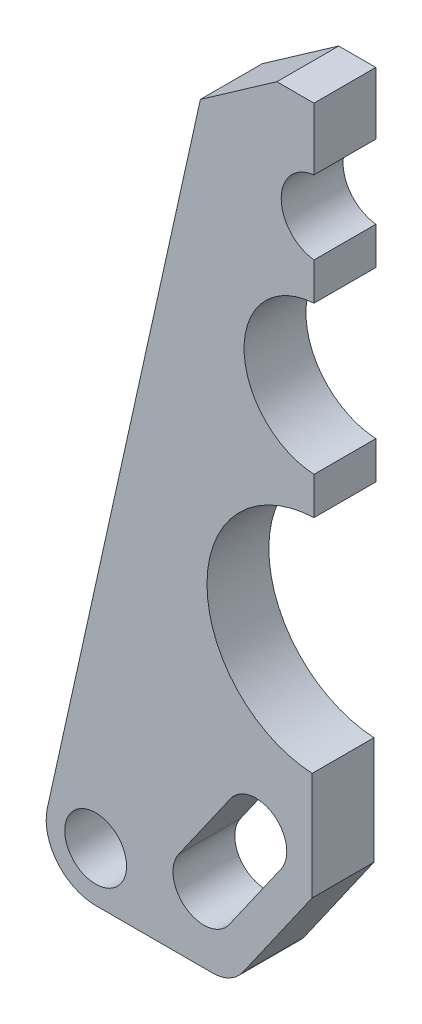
ISO-10303-21;
HEADER;
FILE_DESCRIPTION(('STEP AP214'),'2;1');
FILE_NAME('part.step','',(''),(''),'','','');
FILE_SCHEMA(('AUTOMOTIVE_DESIGN { 1 0 10303 214 1 1 1 1 }'));
ENDSEC;
DATA;
#1=APPLICATION_CONTEXT('core data for automotive mechanical design processes');
#2=APPLICATION_PROTOCOL_DEFINITION('international standard','automotive_design',2000,#1);
#3=PRODUCT_CONTEXT('',#1,'mechanical');
#4=PRODUCT('Part','Part','',(#3));
#5=PRODUCT_RELATED_PRODUCT_CATEGORY('part','',(#4));
#6=PRODUCT_DEFINITION_FORMATION('','',#4);
#7=PRODUCT_DEFINITION_CONTEXT('part definition',#1,'design');
#8=PRODUCT_DEFINITION('design','',#6,#7);
#9=PRODUCT_DEFINITION_SHAPE('','',#8);
#10=(LENGTH_UNIT() NAMED_UNIT(*) SI_UNIT(.MILLI.,.METRE.));
#11=(NAMED_UNIT(*) PLANE_ANGLE_UNIT() SI_UNIT($,.RADIAN.));
#12=(NAMED_UNIT(*) SI_UNIT($,.STERADIAN.) SOLID_ANGLE_UNIT());
#13=UNCERTAINTY_MEASURE_WITH_UNIT(LENGTH_MEASURE(1.E-05),#10,'distance_accuracy_value','');
#14=(GEOMETRIC_REPRESENTATION_CONTEXT(3) GLOBAL_UNCERTAINTY_ASSIGNED_CONTEXT((#13)) GLOBAL_UNIT_ASSIGNED_CONTEXT((#10,
#11,#12)) REPRESENTATION_CONTEXT('',''));
#15=CARTESIAN_POINT('',(0.,0.,0.));
#16=DIRECTION('',(0.,0.,1.));
#17=DIRECTION('',(1.,0.,0.));
#18=AXIS2_PLACEMENT_3D('',#15,#16,#17);
#19=CARTESIAN_POINT('',(-18.,-4.,5.));
#20=DIRECTION('',(0.,0.,1.));
#21=DIRECTION('',(1.,0.,0.));
#22=AXIS2_PLACEMENT_3D('',#19,#20,#21);
#23=PLANE('',#22);
#24=CARTESIAN_POINT('',(-18.,-4.,5.));
#25=DIRECTION('',(0.,0.,1.));
#26=DIRECTION('',(1.,0.,0.));
#27=AXIS2_PLACEMENT_3D('',#24,#25,#26);
#28=CIRCLE('',#27,2.5);
#29=CARTESIAN_POINT('',(-15.5,-4.,5.));
#30=VERTEX_POINT('',#29);
#31=EDGE_CURVE('E206',#30,#30,#28,.T.);
#32=ORIENTED_EDGE('',*,*,#31,.F.);
#33=EDGE_LOOP('',(#32));
#34=FACE_BOUND('',#33,.T.);
#35=DIRECTION('',(1.,0.,0.));
#36=VECTOR('',#35,1.);
#37=CARTESIAN_POINT('',(-6.9972685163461,-8.,5.));
#38=LINE('',#37,#36);
#39=CARTESIAN_POINT('',(-18.,-8.,5.));
#40=VERTEX_POINT('',#39);
#41=CARTESIAN_POINT('',(-8.55896966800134,-8.,5.));
#42=VERTEX_POINT('',#41);
#43=EDGE_CURVE('E235',#40,#42,#38,.T.);
#44=ORIENTED_EDGE('',*,*,#43,.T.);
#45=CARTESIAN_POINT('',(-8.55896966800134,-5.,5.));
#46=DIRECTION('',(0.,0.,1.));
#47=DIRECTION('',(1.,0.,0.));
#48=AXIS2_PLACEMENT_3D('',#45,#46,#47);
#49=CIRCLE('',#48,3.);
#50=CARTESIAN_POINT('',(-6.10151353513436,-6.72072930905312,5.));
#51=VERTEX_POINT('',#50);
#52=EDGE_CURVE('E11',#42,#51,#49,.T.);
#53=ORIENTED_EDGE('',*,*,#52,.T.);
#54=DIRECTION('',(0.573576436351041,0.819152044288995,0.));
#55=VECTOR('',#54,1.);
#56=CARTESIAN_POINT('',(-6.9972685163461,-8.,5.));
#57=LINE('',#56,#55);
#58=CARTESIAN_POINT('',(-0.499999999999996,1.27906108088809,5.));
#59=VERTEX_POINT('',#58);
#60=EDGE_CURVE('E237',#51,#59,#57,.T.);
#61=ORIENTED_EDGE('',*,*,#60,.T.);
#62=DIRECTION('',(0.,1.,0.));
#63=VECTOR('',#62,1.);
#64=CARTESIAN_POINT('',(-0.499999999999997,10.0002211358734,5.));
#65=LINE('',#64,#63);
#66=CARTESIAN_POINT('',(-0.499999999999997,10.0002211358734,5.));
#67=VERTEX_POINT('',#66);
#68=EDGE_CURVE('E239',#59,#67,#65,.T.);
#69=ORIENTED_EDGE('',*,*,#68,.T.);
#70=CARTESIAN_POINT('',(0.,18.9863215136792,5.));
#71=DIRECTION('',(0.,0.,-1.));
#72=DIRECTION('',(1.,0.,0.));
#73=AXIS2_PLACEMENT_3D('',#70,#71,#72);
#74=CIRCLE('',#73,9.);
#75=CARTESIAN_POINT('',(-0.349999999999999,27.9795133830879,5.));
#76=VERTEX_POINT('',#75);
#77=EDGE_CURVE('E241',#67,#76,#74,.T.);
#78=ORIENTED_EDGE('',*,*,#77,.T.);
#79=DIRECTION('',(0.,1.,0.));
#80=VECTOR('',#79,1.);
#81=CARTESIAN_POINT('',(-0.349999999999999,31.0102170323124,5.));
#82=LINE('',#81,#80);
#83=CARTESIAN_POINT('',(-0.349999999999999,31.0102170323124,5.));
#84=VERTEX_POINT('',#83);
#85=EDGE_CURVE('E243',#76,#84,#82,.T.);
#86=ORIENTED_EDGE('',*,*,#85,.T.);
#87=CARTESIAN_POINT('',(0.,37.,5.));
#88=DIRECTION('',(0.,0.,-1.));
#89=DIRECTION('',(1.,0.,0.));
#90=AXIS2_PLACEMENT_3D('',#87,#88,#89);
#91=CIRCLE('',#90,6.);
#92=CARTESIAN_POINT('',(-0.350000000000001,42.9897829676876,5.));
#93=VERTEX_POINT('',#92);
#94=EDGE_CURVE('E245',#84,#93,#91,.T.);
#95=ORIENTED_EDGE('',*,*,#94,.T.);
#96=DIRECTION('',(0.,1.,0.));
#97=VECTOR('',#96,1.);
#98=CARTESIAN_POINT('',(-0.350000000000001,46.0204866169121,5.));
#99=LINE('',#98,#97);
#100=CARTESIAN_POINT('',(-0.350000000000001,46.0204866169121,5.));
#101=VERTEX_POINT('',#100);
#102=EDGE_CURVE('E247',#93,#101,#99,.T.);
#103=ORIENTED_EDGE('',*,*,#102,.T.);
#104=CARTESIAN_POINT('',(0.,49.,5.));
#105=DIRECTION('',(0.,0.,-1.));
#106=DIRECTION('',(1.,0.,0.));
#107=AXIS2_PLACEMENT_3D('',#104,#105,#106);
#108=CIRCLE('',#107,3.);
#109=CARTESIAN_POINT('',(-0.350000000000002,51.9795133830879,5.));
#110=VERTEX_POINT('',#109);
#111=EDGE_CURVE('E249',#101,#110,#108,.T.);
#112=ORIENTED_EDGE('',*,*,#111,.T.);
#113=DIRECTION('',(0.,1.,0.));
#114=VECTOR('',#113,1.);
#115=CARTESIAN_POINT('',(-0.350000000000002,51.9795133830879,5.));
#116=LINE('',#115,#114);
#117=CARTESIAN_POINT('',(-0.350000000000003,57.,5.));
#118=VERTEX_POINT('',#117);
#119=EDGE_CURVE('E251',#110,#118,#116,.T.);
#120=ORIENTED_EDGE('',*,*,#119,.T.);
#121=DIRECTION('',(-1.,0.,0.));
#122=VECTOR('',#121,1.);
#123=CARTESIAN_POINT('',(-3.35,57.,5.));
#124=LINE('',#123,#122);
#125=CARTESIAN_POINT('',(-3.35,57.,5.));
#126=VERTEX_POINT('',#125);
#127=EDGE_CURVE('E253',#118,#126,#124,.T.);
#128=ORIENTED_EDGE('',*,*,#127,.T.);
#129=DIRECTION('',(-0.819152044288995,-0.573576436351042,0.));
#130=VECTOR('',#129,1.);
#131=CARTESIAN_POINT('',(-3.35,57.,5.));
#132=LINE('',#131,#130);
#133=CARTESIAN_POINT('',(-9.53364489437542,52.6701652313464,5.));
#134=VERTEX_POINT('',#133);
#135=EDGE_CURVE('E255',#126,#134,#132,.T.);
#136=ORIENTED_EDGE('',*,*,#135,.T.);
#137=DIRECTION('',(-0.216439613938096,-0.976296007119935,0.));
#138=VECTOR('',#137,1.);
#139=CARTESIAN_POINT('',(-21.9051840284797,-3.13424154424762,5.));
#140=LINE('',#139,#138);
#141=CARTESIAN_POINT('',(-21.9051840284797,-3.13424154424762,5.));
#142=VERTEX_POINT('',#141);
#143=EDGE_CURVE('E257',#134,#142,#140,.T.);
#144=ORIENTED_EDGE('',*,*,#143,.T.);
#145=CARTESIAN_POINT('',(-18.,-4.,5.));
#146=DIRECTION('',(0.,0.,1.));
#147=DIRECTION('',(1.,0.,0.));
#148=AXIS2_PLACEMENT_3D('',#145,#146,#147);
#149=CIRCLE('',#148,4.);
#150=EDGE_CURVE('E259',#142,#40,#149,.T.);
#151=ORIENTED_EDGE('',*,*,#150,.T.);
#152=EDGE_LOOP('',(#44,#53,#61,#69,#78,#86,#95,#103,#112,#120,#128,#136,#144,#151));
#153=FACE_BOUND('',#152,.T.);
#154=DIRECTION('',(0.573576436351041,0.819152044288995,0.));
#155=VECTOR('',#154,1.);
#156=CARTESIAN_POINT('',(-7.20211988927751,-3.9339410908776,5.));
#157=LINE('',#156,#155);
#158=CARTESIAN_POINT('',(-7.20211988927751,-3.9339410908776,5.));
#159=VERTEX_POINT('',#158);
#160=CARTESIAN_POINT('',(-3.0008746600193,2.0660589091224,5.));
#161=VERTEX_POINT('',#160);
#162=EDGE_CURVE('E192',#159,#161,#157,.T.);
#163=ORIENTED_EDGE('',*,*,#162,.F.);
#164=CARTESIAN_POINT('',(-9.24999999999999,-2.5,5.));
#165=DIRECTION('',(0.,0.,1.));
#166=DIRECTION('',(1.,0.,0.));
#167=AXIS2_PLACEMENT_3D('',#164,#165,#166);
#168=CIRCLE('',#167,2.5);
#169=CARTESIAN_POINT('',(-11.2978801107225,-1.0660589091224,5.));
#170=VERTEX_POINT('',#169);
#171=EDGE_CURVE('E180',#170,#159,#168,.T.);
#172=ORIENTED_EDGE('',*,*,#171,.F.);
#173=DIRECTION('',(-0.573576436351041,-0.819152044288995,0.));
#174=VECTOR('',#173,1.);
#175=CARTESIAN_POINT('',(-11.2978801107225,-1.0660589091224,5.));
#176=LINE('',#175,#174);
#177=CARTESIAN_POINT('',(-7.09663488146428,4.9339410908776,5.));
#178=VERTEX_POINT('',#177);
#179=EDGE_CURVE('E197',#178,#170,#176,.T.);
#180=ORIENTED_EDGE('',*,*,#179,.F.);
#181=CARTESIAN_POINT('',(-5.04875477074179,3.5,5.));
#182=DIRECTION('',(0.,0.,1.));
#183=DIRECTION('',(1.,0.,0.));
#184=AXIS2_PLACEMENT_3D('',#181,#182,#183);
#185=CIRCLE('',#184,2.5);
#186=EDGE_CURVE('E194',#161,#178,#185,.T.);
#187=ORIENTED_EDGE('',*,*,#186,.F.);
#188=EDGE_LOOP('',(#163,#172,#180,#187));
#189=FACE_BOUND('',#188,.T.);
#190=ADVANCED_FACE('F36',(#34,#153,#189),#23,.T.);
#191=CARTESIAN_POINT('',(-18.,-4.,0.));
#192=DIRECTION('',(0.,0.,1.));
#193=DIRECTION('',(1.,0.,0.));
#194=AXIS2_PLACEMENT_3D('',#191,#192,#193);
#195=PLANE('',#194);
#196=CARTESIAN_POINT('',(-18.,-4.,0.));
#197=DIRECTION('',(0.,0.,1.));
#198=DIRECTION('',(1.,0.,0.));
#199=AXIS2_PLACEMENT_3D('',#196,#197,#198);
#200=CIRCLE('',#199,2.5);
#201=CARTESIAN_POINT('',(-15.5,-4.,0.));
#202=VERTEX_POINT('',#201);
#203=EDGE_CURVE('E181',#202,#202,#200,.T.);
#204=ORIENTED_EDGE('',*,*,#203,.T.);
#205=EDGE_LOOP('',(#204));
#206=FACE_BOUND('',#205,.T.);
#207=DIRECTION('',(0.573576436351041,0.819152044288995,0.));
#208=VECTOR('',#207,1.);
#209=CARTESIAN_POINT('',(-6.9972685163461,-8.,0.));
#210=LINE('',#209,#208);
#211=CARTESIAN_POINT('',(-6.10151353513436,-6.72072930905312,0.));
#212=VERTEX_POINT('',#211);
#213=CARTESIAN_POINT('',(-0.499999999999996,1.27906108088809,0.));
#214=VERTEX_POINT('',#213);
#215=EDGE_CURVE('E211',#212,#214,#210,.T.);
#216=ORIENTED_EDGE('',*,*,#215,.F.);
#217=CARTESIAN_POINT('',(-8.55896966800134,-5.,0.));
#218=DIRECTION('',(0.,0.,1.));
#219=DIRECTION('',(1.,0.,0.));
#220=AXIS2_PLACEMENT_3D('',#217,#218,#219);
#221=CIRCLE('',#220,3.);
#222=CARTESIAN_POINT('',(-8.55896966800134,-8.,0.));
#223=VERTEX_POINT('',#222);
#224=EDGE_CURVE('E58',#212,#223,#221,.F.);
#225=ORIENTED_EDGE('',*,*,#224,.T.);
#226=DIRECTION('',(1.,0.,0.));
#227=VECTOR('',#226,1.);
#228=CARTESIAN_POINT('',(-6.9972685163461,-8.,0.));
#229=LINE('',#228,#227);
#230=CARTESIAN_POINT('',(-18.,-8.,0.));
#231=VERTEX_POINT('',#230);
#232=EDGE_CURVE('E209',#231,#223,#229,.T.);
#233=ORIENTED_EDGE('',*,*,#232,.F.);
#234=CARTESIAN_POINT('',(-18.,-4.,0.));
#235=DIRECTION('',(0.,0.,1.));
#236=DIRECTION('',(1.,0.,0.));
#237=AXIS2_PLACEMENT_3D('',#234,#235,#236);
#238=CIRCLE('',#237,4.);
#239=CARTESIAN_POINT('',(-21.9051840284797,-3.13424154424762,0.));
#240=VERTEX_POINT('',#239);
#241=EDGE_CURVE('E233',#240,#231,#238,.T.);
#242=ORIENTED_EDGE('',*,*,#241,.F.);
#243=DIRECTION('',(-0.216439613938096,-0.976296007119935,0.));
#244=VECTOR('',#243,1.);
#245=CARTESIAN_POINT('',(-21.9051840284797,-3.13424154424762,0.));
#246=LINE('',#245,#244);
#247=CARTESIAN_POINT('',(-9.53364489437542,52.6701652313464,0.));
#248=VERTEX_POINT('',#247);
#249=EDGE_CURVE('E231',#248,#240,#246,.T.);
#250=ORIENTED_EDGE('',*,*,#249,.F.);
#251=DIRECTION('',(-0.819152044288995,-0.573576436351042,0.));
#252=VECTOR('',#251,1.);
#253=CARTESIAN_POINT('',(-3.35,57.,0.));
#254=LINE('',#253,#252);
#255=CARTESIAN_POINT('',(-3.35,57.,0.));
#256=VERTEX_POINT('',#255);
#257=EDGE_CURVE('E229',#256,#248,#254,.T.);
#258=ORIENTED_EDGE('',*,*,#257,.F.);
#259=DIRECTION('',(-1.,0.,0.));
#260=VECTOR('',#259,1.);
#261=CARTESIAN_POINT('',(-3.35,57.,0.));
#262=LINE('',#261,#260);
#263=CARTESIAN_POINT('',(-0.350000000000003,57.,0.));
#264=VERTEX_POINT('',#263);
#265=EDGE_CURVE('E227',#264,#256,#262,.T.);
#266=ORIENTED_EDGE('',*,*,#265,.F.);
#267=DIRECTION('',(0.,1.,0.));
#268=VECTOR('',#267,1.);
#269=CARTESIAN_POINT('',(-0.350000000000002,51.9795133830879,0.));
#270=LINE('',#269,#268);
#271=CARTESIAN_POINT('',(-0.350000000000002,51.9795133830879,0.));
#272=VERTEX_POINT('',#271);
#273=EDGE_CURVE('E225',#272,#264,#270,.T.);
#274=ORIENTED_EDGE('',*,*,#273,.F.);
#275=CARTESIAN_POINT('',(0.,49.,0.));
#276=DIRECTION('',(0.,0.,-1.));
#277=DIRECTION('',(1.,0.,0.));
#278=AXIS2_PLACEMENT_3D('',#275,#276,#277);
#279=CIRCLE('',#278,3.);
#280=CARTESIAN_POINT('',(-0.350000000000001,46.0204866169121,0.));
#281=VERTEX_POINT('',#280);
#282=EDGE_CURVE('E223',#281,#272,#279,.T.);
#283=ORIENTED_EDGE('',*,*,#282,.F.);
#284=DIRECTION('',(0.,1.,0.));
#285=VECTOR('',#284,1.);
#286=CARTESIAN_POINT('',(-0.350000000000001,46.0204866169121,0.));
#287=LINE('',#286,#285);
#288=CARTESIAN_POINT('',(-0.350000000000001,42.9897829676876,0.));
#289=VERTEX_POINT('',#288);
#290=EDGE_CURVE('E221',#289,#281,#287,.T.);
#291=ORIENTED_EDGE('',*,*,#290,.F.);
#292=CARTESIAN_POINT('',(0.,37.,0.));
#293=DIRECTION('',(0.,0.,-1.));
#294=DIRECTION('',(1.,0.,0.));
#295=AXIS2_PLACEMENT_3D('',#292,#293,#294);
#296=CIRCLE('',#295,6.);
#297=CARTESIAN_POINT('',(-0.349999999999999,31.0102170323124,0.));
#298=VERTEX_POINT('',#297);
#299=EDGE_CURVE('E219',#298,#289,#296,.T.);
#300=ORIENTED_EDGE('',*,*,#299,.F.);
#301=DIRECTION('',(0.,1.,0.));
#302=VECTOR('',#301,1.);
#303=CARTESIAN_POINT('',(-0.349999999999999,31.0102170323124,0.));
#304=LINE('',#303,#302);
#305=CARTESIAN_POINT('',(-0.349999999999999,27.9795133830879,0.));
#306=VERTEX_POINT('',#305);
#307=EDGE_CURVE('E217',#306,#298,#304,.T.);
#308=ORIENTED_EDGE('',*,*,#307,.F.);
#309=CARTESIAN_POINT('',(0.,18.9863215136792,0.));
#310=DIRECTION('',(0.,0.,-1.));
#311=DIRECTION('',(1.,0.,0.));
#312=AXIS2_PLACEMENT_3D('',#309,#310,#311);
#313=CIRCLE('',#312,9.);
#314=CARTESIAN_POINT('',(-0.499999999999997,10.0002211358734,0.));
#315=VERTEX_POINT('',#314);
#316=EDGE_CURVE('E215',#315,#306,#313,.T.);
#317=ORIENTED_EDGE('',*,*,#316,.F.);
#318=DIRECTION('',(0.,1.,0.));
#319=VECTOR('',#318,1.);
#320=CARTESIAN_POINT('',(-0.499999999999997,10.0002211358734,0.));
#321=LINE('',#320,#319);
#322=EDGE_CURVE('E213',#214,#315,#321,.T.);
#323=ORIENTED_EDGE('',*,*,#322,.F.);
#324=EDGE_LOOP('',(#216,#225,#233,#242,#250,#258,#266,#274,#283,#291,#300,#308,#317,#323));
#325=FACE_BOUND('',#324,.T.);
#326=CARTESIAN_POINT('',(-9.24999999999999,-2.5,0.));
#327=DIRECTION('',(0.,0.,1.));
#328=DIRECTION('',(1.,0.,0.));
#329=AXIS2_PLACEMENT_3D('',#326,#327,#328);
#330=CIRCLE('',#329,2.5);
#331=CARTESIAN_POINT('',(-11.2978801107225,-1.0660589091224,0.));
#332=VERTEX_POINT('',#331);
#333=CARTESIAN_POINT('',(-7.20211988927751,-3.9339410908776,0.));
#334=VERTEX_POINT('',#333);
#335=EDGE_CURVE('E173',#332,#334,#330,.T.);
#336=ORIENTED_EDGE('',*,*,#335,.T.);
#337=DIRECTION('',(0.573576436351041,0.819152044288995,0.));
#338=VECTOR('',#337,1.);
#339=CARTESIAN_POINT('',(-7.20211988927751,-3.9339410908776,0.));
#340=LINE('',#339,#338);
#341=CARTESIAN_POINT('',(-3.0008746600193,2.0660589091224,0.));
#342=VERTEX_POINT('',#341);
#343=EDGE_CURVE('E161',#334,#342,#340,.T.);
#344=ORIENTED_EDGE('',*,*,#343,.T.);
#345=CARTESIAN_POINT('',(-5.04875477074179,3.5,0.));
#346=DIRECTION('',(0.,0.,1.));
#347=DIRECTION('',(1.,0.,0.));
#348=AXIS2_PLACEMENT_3D('',#345,#346,#347);
#349=CIRCLE('',#348,2.5);
#350=CARTESIAN_POINT('',(-7.09663488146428,4.9339410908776,0.));
#351=VERTEX_POINT('',#350);
#352=EDGE_CURVE('E172',#342,#351,#349,.T.);
#353=ORIENTED_EDGE('',*,*,#352,.T.);
#354=DIRECTION('',(-0.573576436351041,-0.819152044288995,0.));
#355=VECTOR('',#354,1.);
#356=CARTESIAN_POINT('',(-11.2978801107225,-1.0660589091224,0.));
#357=LINE('',#356,#355);
#358=EDGE_CURVE('E186',#351,#332,#357,.T.);
#359=ORIENTED_EDGE('',*,*,#358,.T.);
#360=EDGE_LOOP('',(#336,#344,#353,#359));
#361=FACE_BOUND('',#360,.T.);
#362=ADVANCED_FACE('F184',(#206,#325,#361),#195,.F.);
#363=CARTESIAN_POINT('',(-6.9972685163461,-8.,5.));
#364=DIRECTION('',(0.,1.,0.));
#365=DIRECTION('',(-1.,0.,0.));
#366=AXIS2_PLACEMENT_3D('',#363,#364,#365);
#367=PLANE('',#366);
#368=ORIENTED_EDGE('',*,*,#232,.T.);
#369=DIRECTION('',(0.,0.,-1.));
#370=VECTOR('',#369,1.);
#371=CARTESIAN_POINT('',(-8.55896966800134,-8.,5.));
#372=LINE('',#371,#370);
#373=EDGE_CURVE('E44',#223,#42,#372,.F.);
#374=ORIENTED_EDGE('',*,*,#373,.T.);
#375=ORIENTED_EDGE('',*,*,#43,.F.);
#376=DIRECTION('',(0.,0.,-1.));
#377=VECTOR('',#376,1.);
#378=CARTESIAN_POINT('',(-18.,-8.,5.));
#379=LINE('',#378,#377);
#380=EDGE_CURVE('E261',#40,#231,#379,.T.);
#381=ORIENTED_EDGE('',*,*,#380,.T.);
#382=EDGE_LOOP('',(#368,#374,#375,#381));
#383=FACE_BOUND('',#382,.T.);
#384=ADVANCED_FACE('F38',(#383),#367,.F.);
#385=CARTESIAN_POINT('',(-6.9972685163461,-8.,5.));
#386=DIRECTION('',(-0.819152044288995,0.573576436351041,0.));
#387=DIRECTION('',(-0.573576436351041,-0.819152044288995,0.));
#388=AXIS2_PLACEMENT_3D('',#385,#386,#387);
#389=PLANE('',#388);
#390=ORIENTED_EDGE('',*,*,#60,.F.);
#391=DIRECTION('',(0.,0.,-1.));
#392=VECTOR('',#391,1.);
#393=CARTESIAN_POINT('',(-6.10151353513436,-6.72072930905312,5.));
#394=LINE('',#393,#392);
#395=EDGE_CURVE('E297',#51,#212,#394,.T.);
#396=ORIENTED_EDGE('',*,*,#395,.T.);
#397=ORIENTED_EDGE('',*,*,#215,.T.);
#398=DIRECTION('',(0.,0.,-1.));
#399=VECTOR('',#398,1.);
#400=CARTESIAN_POINT('',(-0.499999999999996,1.27906108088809,5.));
#401=LINE('',#400,#399);
#402=EDGE_CURVE('E294',#59,#214,#401,.T.);
#403=ORIENTED_EDGE('',*,*,#402,.F.);
#404=EDGE_LOOP('',(#390,#396,#397,#403));
#405=FACE_BOUND('',#404,.T.);
#406=ADVANCED_FACE('F303',(#405),#389,.F.);
#407=CARTESIAN_POINT('',(-0.499999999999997,10.0002211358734,5.));
#408=DIRECTION('',(-1.,0.,0.));
#409=DIRECTION('',(0.,-1.,0.));
#410=AXIS2_PLACEMENT_3D('',#407,#408,#409);
#411=PLANE('',#410);
#412=ORIENTED_EDGE('',*,*,#322,.T.);
#413=DIRECTION('',(0.,0.,-1.));
#414=VECTOR('',#413,1.);
#415=CARTESIAN_POINT('',(-0.499999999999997,10.0002211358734,5.));
#416=LINE('',#415,#414);
#417=EDGE_CURVE('E291',#67,#315,#416,.T.);
#418=ORIENTED_EDGE('',*,*,#417,.F.);
#419=ORIENTED_EDGE('',*,*,#68,.F.);
#420=ORIENTED_EDGE('',*,*,#402,.T.);
#421=EDGE_LOOP('',(#412,#418,#419,#420));
#422=FACE_BOUND('',#421,.T.);
#423=ADVANCED_FACE('F312',(#422),#411,.F.);
#424=CARTESIAN_POINT('',(0.,18.9863215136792,5.));
#425=DIRECTION('',(0.,0.,-1.));
#426=DIRECTION('',(-1.,0.,0.));
#427=AXIS2_PLACEMENT_3D('',#424,#425,#426);
#428=CYLINDRICAL_SURFACE('',#427,9.);
#429=ORIENTED_EDGE('',*,*,#316,.T.);
#430=DIRECTION('',(0.,0.,-1.));
#431=VECTOR('',#430,1.);
#432=CARTESIAN_POINT('',(-0.349999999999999,27.9795133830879,5.));
#433=LINE('',#432,#431);
#434=EDGE_CURVE('E288',#76,#306,#433,.T.);
#435=ORIENTED_EDGE('',*,*,#434,.F.);
#436=ORIENTED_EDGE('',*,*,#77,.F.);
#437=ORIENTED_EDGE('',*,*,#417,.T.);
#438=EDGE_LOOP('',(#429,#435,#436,#437));
#439=FACE_BOUND('',#438,.T.);
#440=ADVANCED_FACE('F316',(#439),#428,.F.);
#441=CARTESIAN_POINT('',(-0.349999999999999,31.0102170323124,5.));
#442=DIRECTION('',(-1.,0.,0.));
#443=DIRECTION('',(0.,-1.,0.));
#444=AXIS2_PLACEMENT_3D('',#441,#442,#443);
#445=PLANE('',#444);
#446=ORIENTED_EDGE('',*,*,#307,.T.);
#447=DIRECTION('',(0.,0.,-1.));
#448=VECTOR('',#447,1.);
#449=CARTESIAN_POINT('',(-0.349999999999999,31.0102170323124,5.));
#450=LINE('',#449,#448);
#451=EDGE_CURVE('E285',#84,#298,#450,.T.);
#452=ORIENTED_EDGE('',*,*,#451,.F.);
#453=ORIENTED_EDGE('',*,*,#85,.F.);
#454=ORIENTED_EDGE('',*,*,#434,.T.);
#455=EDGE_LOOP('',(#446,#452,#453,#454));
#456=FACE_BOUND('',#455,.T.);
#457=ADVANCED_FACE('F375',(#456),#445,.F.);
#458=CARTESIAN_POINT('',(0.,37.,5.));
#459=DIRECTION('',(0.,0.,-1.));
#460=DIRECTION('',(-1.,0.,0.));
#461=AXIS2_PLACEMENT_3D('',#458,#459,#460);
#462=CYLINDRICAL_SURFACE('',#461,6.);
#463=ORIENTED_EDGE('',*,*,#299,.T.);
#464=DIRECTION('',(0.,0.,-1.));
#465=VECTOR('',#464,1.);
#466=CARTESIAN_POINT('',(-0.350000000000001,42.9897829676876,5.));
#467=LINE('',#466,#465);
#468=EDGE_CURVE('E282',#93,#289,#467,.T.);
#469=ORIENTED_EDGE('',*,*,#468,.F.);
#470=ORIENTED_EDGE('',*,*,#94,.F.);
#471=ORIENTED_EDGE('',*,*,#451,.T.);
#472=EDGE_LOOP('',(#463,#469,#470,#471));
#473=FACE_BOUND('',#472,.T.);
#474=ADVANCED_FACE('F371',(#473),#462,.F.);
#475=CARTESIAN_POINT('',(-0.350000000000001,46.0204866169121,5.));
#476=DIRECTION('',(-1.,0.,0.));
#477=DIRECTION('',(0.,-1.,0.));
#478=AXIS2_PLACEMENT_3D('',#475,#476,#477);
#479=PLANE('',#478);
#480=ORIENTED_EDGE('',*,*,#290,.T.);
#481=DIRECTION('',(0.,0.,-1.));
#482=VECTOR('',#481,1.);
#483=CARTESIAN_POINT('',(-0.350000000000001,46.0204866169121,5.));
#484=LINE('',#483,#482);
#485=EDGE_CURVE('E279',#101,#281,#484,.T.);
#486=ORIENTED_EDGE('',*,*,#485,.F.);
#487=ORIENTED_EDGE('',*,*,#102,.F.);
#488=ORIENTED_EDGE('',*,*,#468,.T.);
#489=EDGE_LOOP('',(#480,#486,#487,#488));
#490=FACE_BOUND('',#489,.T.);
#491=ADVANCED_FACE('F367',(#490),#479,.F.);
#492=CARTESIAN_POINT('',(0.,49.,5.));
#493=DIRECTION('',(0.,0.,-1.));
#494=DIRECTION('',(-1.,0.,0.));
#495=AXIS2_PLACEMENT_3D('',#492,#493,#494);
#496=CYLINDRICAL_SURFACE('',#495,3.);
#497=ORIENTED_EDGE('',*,*,#282,.T.);
#498=DIRECTION('',(0.,0.,-1.));
#499=VECTOR('',#498,1.);
#500=CARTESIAN_POINT('',(-0.350000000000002,51.9795133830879,5.));
#501=LINE('',#500,#499);
#502=EDGE_CURVE('E276',#110,#272,#501,.T.);
#503=ORIENTED_EDGE('',*,*,#502,.F.);
#504=ORIENTED_EDGE('',*,*,#111,.F.);
#505=ORIENTED_EDGE('',*,*,#485,.T.);
#506=EDGE_LOOP('',(#497,#503,#504,#505));
#507=FACE_BOUND('',#506,.T.);
#508=ADVANCED_FACE('F363',(#507),#496,.F.);
#509=CARTESIAN_POINT('',(-0.350000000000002,51.9795133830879,5.));
#510=DIRECTION('',(-1.,0.,0.));
#511=DIRECTION('',(0.,-1.,0.));
#512=AXIS2_PLACEMENT_3D('',#509,#510,#511);
#513=PLANE('',#512);
#514=ORIENTED_EDGE('',*,*,#273,.T.);
#515=DIRECTION('',(0.,0.,-1.));
#516=VECTOR('',#515,1.);
#517=CARTESIAN_POINT('',(-0.350000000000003,57.,5.));
#518=LINE('',#517,#516);
#519=EDGE_CURVE('E273',#118,#264,#518,.T.);
#520=ORIENTED_EDGE('',*,*,#519,.F.);
#521=ORIENTED_EDGE('',*,*,#119,.F.);
#522=ORIENTED_EDGE('',*,*,#502,.T.);
#523=EDGE_LOOP('',(#514,#520,#521,#522));
#524=FACE_BOUND('',#523,.T.);
#525=ADVANCED_FACE('F359',(#524),#513,.F.);
#526=CARTESIAN_POINT('',(-3.35,57.,5.));
#527=DIRECTION('',(0.,-1.,0.));
#528=DIRECTION('',(0.,0.,-1.));
#529=AXIS2_PLACEMENT_3D('',#526,#527,#528);
#530=PLANE('',#529);
#531=ORIENTED_EDGE('',*,*,#265,.T.);
#532=DIRECTION('',(0.,0.,-1.));
#533=VECTOR('',#532,1.);
#534=CARTESIAN_POINT('',(-3.35,57.,5.));
#535=LINE('',#534,#533);
#536=EDGE_CURVE('E270',#126,#256,#535,.T.);
#537=ORIENTED_EDGE('',*,*,#536,.F.);
#538=ORIENTED_EDGE('',*,*,#127,.F.);
#539=ORIENTED_EDGE('',*,*,#519,.T.);
#540=EDGE_LOOP('',(#531,#537,#538,#539));
#541=FACE_BOUND('',#540,.T.);
#542=ADVANCED_FACE('F355',(#541),#530,.F.);
#543=CARTESIAN_POINT('',(-3.35,57.,5.));
#544=DIRECTION('',(0.573576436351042,-0.819152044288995,0.));
#545=DIRECTION('',(0.819152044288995,0.573576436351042,0.));
#546=AXIS2_PLACEMENT_3D('',#543,#544,#545);
#547=PLANE('',#546);
#548=ORIENTED_EDGE('',*,*,#257,.T.);
#549=DIRECTION('',(0.,0.,-1.));
#550=VECTOR('',#549,1.);
#551=CARTESIAN_POINT('',(-9.53364489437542,52.6701652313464,5.));
#552=LINE('',#551,#550);
#553=EDGE_CURVE('E267',#134,#248,#552,.T.);
#554=ORIENTED_EDGE('',*,*,#553,.F.);
#555=ORIENTED_EDGE('',*,*,#135,.F.);
#556=ORIENTED_EDGE('',*,*,#536,.T.);
#557=EDGE_LOOP('',(#548,#554,#555,#556));
#558=FACE_BOUND('',#557,.T.);
#559=ADVANCED_FACE('F351',(#558),#547,.F.);
#560=CARTESIAN_POINT('',(-21.9051840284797,-3.13424154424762,5.));
#561=DIRECTION('',(0.976296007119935,-0.216439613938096,0.));
#562=DIRECTION('',(0.216439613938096,0.976296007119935,0.));
#563=AXIS2_PLACEMENT_3D('',#560,#561,#562);
#564=PLANE('',#563);
#565=ORIENTED_EDGE('',*,*,#249,.T.);
#566=DIRECTION('',(0.,0.,-1.));
#567=VECTOR('',#566,1.);
#568=CARTESIAN_POINT('',(-21.9051840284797,-3.13424154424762,5.));
#569=LINE('',#568,#567);
#570=EDGE_CURVE('E264',#142,#240,#569,.T.);
#571=ORIENTED_EDGE('',*,*,#570,.F.);
#572=ORIENTED_EDGE('',*,*,#143,.F.);
#573=ORIENTED_EDGE('',*,*,#553,.T.);
#574=EDGE_LOOP('',(#565,#571,#572,#573));
#575=FACE_BOUND('',#574,.T.);
#576=ADVANCED_FACE('F347',(#575),#564,.F.);
#577=CARTESIAN_POINT('',(-18.,-4.,5.));
#578=DIRECTION('',(0.,0.,-1.));
#579=DIRECTION('',(-1.,0.,0.));
#580=AXIS2_PLACEMENT_3D('',#577,#578,#579);
#581=CYLINDRICAL_SURFACE('',#580,4.);
#582=ORIENTED_EDGE('',*,*,#241,.T.);
#583=ORIENTED_EDGE('',*,*,#380,.F.);
#584=ORIENTED_EDGE('',*,*,#150,.F.);
#585=ORIENTED_EDGE('',*,*,#570,.T.);
#586=EDGE_LOOP('',(#582,#583,#584,#585));
#587=FACE_BOUND('',#586,.T.);
#588=ADVANCED_FACE('F343',(#587),#581,.T.);
#589=CARTESIAN_POINT('',(-18.,-4.,5.));
#590=DIRECTION('',(0.,0.,-1.));
#591=DIRECTION('',(-1.,0.,0.));
#592=AXIS2_PLACEMENT_3D('',#589,#590,#591);
#593=CYLINDRICAL_SURFACE('',#592,2.5);
#594=ORIENTED_EDGE('',*,*,#31,.T.);
#595=EDGE_LOOP('',(#594));
#596=FACE_BOUND('',#595,.T.);
#597=ORIENTED_EDGE('',*,*,#203,.F.);
#598=EDGE_LOOP('',(#597));
#599=FACE_BOUND('',#598,.T.);
#600=ADVANCED_FACE('F346',(#596,#599),#593,.F.);
#601=CARTESIAN_POINT('',(-9.24999999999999,-2.5,5.));
#602=DIRECTION('',(0.,0.,-1.));
#603=DIRECTION('',(-1.,0.,0.));
#604=AXIS2_PLACEMENT_3D('',#601,#602,#603);
#605=CYLINDRICAL_SURFACE('',#604,2.5);
#606=ORIENTED_EDGE('',*,*,#335,.F.);
#607=DIRECTION('',(0.,0.,-1.));
#608=VECTOR('',#607,1.);
#609=CARTESIAN_POINT('',(-11.2978801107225,-1.0660589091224,5.));
#610=LINE('',#609,#608);
#611=EDGE_CURVE('E199',#170,#332,#610,.T.);
#612=ORIENTED_EDGE('',*,*,#611,.F.);
#613=ORIENTED_EDGE('',*,*,#171,.T.);
#614=DIRECTION('',(0.,0.,-1.));
#615=VECTOR('',#614,1.);
#616=CARTESIAN_POINT('',(-7.20211988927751,-3.9339410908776,5.));
#617=LINE('',#616,#615);
#618=EDGE_CURVE('E164',#159,#334,#617,.T.);
#619=ORIENTED_EDGE('',*,*,#618,.T.);
#620=EDGE_LOOP('',(#606,#612,#613,#619));
#621=FACE_BOUND('',#620,.T.);
#622=ADVANCED_FACE('F176',(#621),#605,.F.);
#623=CARTESIAN_POINT('',(-7.20211988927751,-3.9339410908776,5.));
#624=DIRECTION('',(-0.819152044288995,0.573576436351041,0.));
#625=DIRECTION('',(-0.573576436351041,-0.819152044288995,0.));
#626=AXIS2_PLACEMENT_3D('',#623,#624,#625);
#627=PLANE('',#626);
#628=ORIENTED_EDGE('',*,*,#343,.F.);
#629=ORIENTED_EDGE('',*,*,#618,.F.);
#630=ORIENTED_EDGE('',*,*,#162,.T.);
#631=DIRECTION('',(0.,0.,-1.));
#632=VECTOR('',#631,1.);
#633=CARTESIAN_POINT('',(-3.0008746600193,2.0660589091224,5.));
#634=LINE('',#633,#632);
#635=EDGE_CURVE('E167',#161,#342,#634,.T.);
#636=ORIENTED_EDGE('',*,*,#635,.T.);
#637=EDGE_LOOP('',(#628,#629,#630,#636));
#638=FACE_BOUND('',#637,.T.);
#639=ADVANCED_FACE('F163',(#638),#627,.T.);
#640=CARTESIAN_POINT('',(-5.04875477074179,3.5,5.));
#641=DIRECTION('',(0.,0.,-1.));
#642=DIRECTION('',(-1.,0.,0.));
#643=AXIS2_PLACEMENT_3D('',#640,#641,#642);
#644=CYLINDRICAL_SURFACE('',#643,2.5);
#645=ORIENTED_EDGE('',*,*,#352,.F.);
#646=ORIENTED_EDGE('',*,*,#635,.F.);
#647=ORIENTED_EDGE('',*,*,#186,.T.);
#648=DIRECTION('',(0.,0.,-1.));
#649=VECTOR('',#648,1.);
#650=CARTESIAN_POINT('',(-7.09663488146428,4.9339410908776,5.));
#651=LINE('',#650,#649);
#652=EDGE_CURVE('E201',#178,#351,#651,.T.);
#653=ORIENTED_EDGE('',*,*,#652,.T.);
#654=EDGE_LOOP('',(#645,#646,#647,#653));
#655=FACE_BOUND('',#654,.T.);
#656=ADVANCED_FACE('F329',(#655),#644,.F.);
#657=CARTESIAN_POINT('',(-11.2978801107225,-1.0660589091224,5.));
#658=DIRECTION('',(0.819152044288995,-0.573576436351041,0.));
#659=DIRECTION('',(0.573576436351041,0.819152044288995,0.));
#660=AXIS2_PLACEMENT_3D('',#657,#658,#659);
#661=PLANE('',#660);
#662=ORIENTED_EDGE('',*,*,#358,.F.);
#663=ORIENTED_EDGE('',*,*,#652,.F.);
#664=ORIENTED_EDGE('',*,*,#179,.T.);
#665=ORIENTED_EDGE('',*,*,#611,.T.);
#666=EDGE_LOOP('',(#662,#663,#664,#665));
#667=FACE_BOUND('',#666,.T.);
#668=ADVANCED_FACE('F324',(#667),#661,.T.);
#669=CARTESIAN_POINT('',(-8.55896966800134,-5.,5.));
#670=DIRECTION('',(0.,0.,-1.));
#671=DIRECTION('',(-1.,0.,0.));
#672=AXIS2_PLACEMENT_3D('',#669,#670,#671);
#673=CYLINDRICAL_SURFACE('',#672,3.);
#674=ORIENTED_EDGE('',*,*,#52,.F.);
#675=ORIENTED_EDGE('',*,*,#373,.F.);
#676=ORIENTED_EDGE('',*,*,#224,.F.);
#677=ORIENTED_EDGE('',*,*,#395,.F.);
#678=EDGE_LOOP('',(#674,#675,#676,#677));
#679=FACE_BOUND('',#678,.T.);
#680=ADVANCED_FACE('F322',(#679),#673,.T.);
#681=CLOSED_SHELL('',(#190,#362,#384,#406,#423,#440,#457,#474,#491,#508,#525,#542,#559,#576,
#588,#600,#622,#639,#656,#668,#680));
#682=MANIFOLD_SOLID_BREP('B2',#681);
#683=ADVANCED_BREP_SHAPE_REPRESENTATION('',(#18,#682),#14);
#684=SHAPE_DEFINITION_REPRESENTATION(#9,#683);
ENDSEC;
END-ISO-10303-21;
